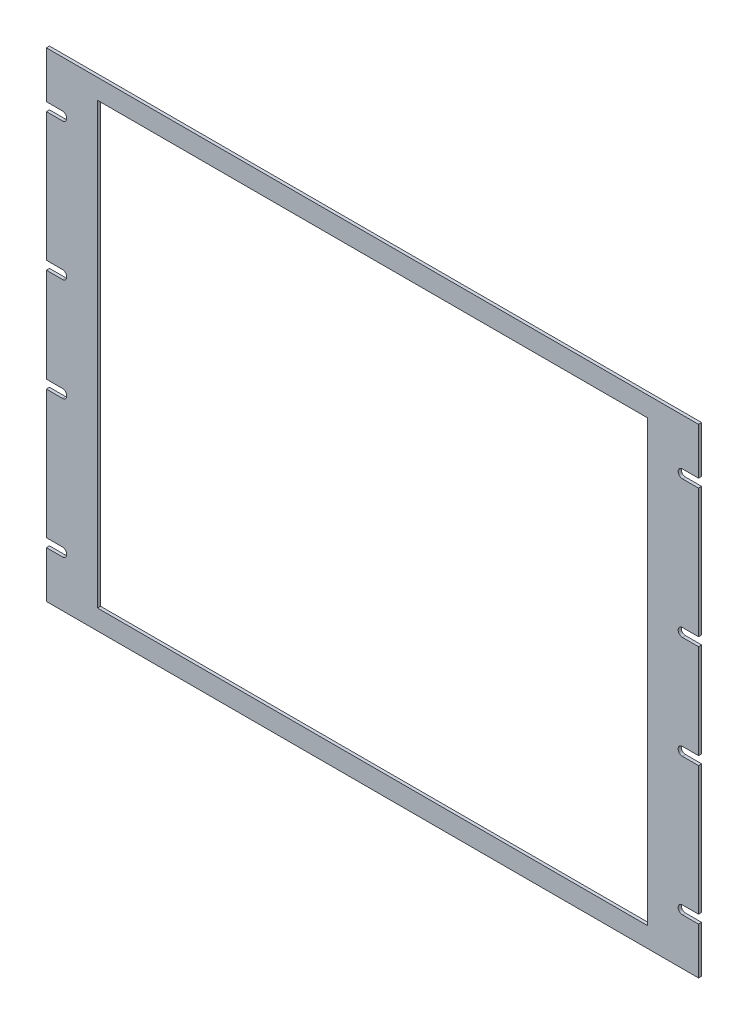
from build123d import *

# Parameters (mm, degrees)
MODEL_W             = 406.908
MODEL_H             = 325.374
BOSS_EXTRUDE1_DEPTH = 2.286


with BuildPart() as part:
    # Model → Boss-Extrude1 (new body)
    with BuildSketch(Plane.XY):
        with BuildLine():
            Line((241.3, -177.3936), (-241.3, -177.3936))
            Line((-241.3, -177.3936), (-241.3, -142.875))
            Line((-241.3, -142.875), (-229.3874, -142.875))
            ThreePointArc((-229.3874, -142.875), (-226.2124, -139.7), (-229.3874, -136.525))
            Line((-229.3874, -136.525), (-241.3, -136.525))
            Line((-241.3, -136.525), (-241.3, -41.275))
            Line((-241.3, -41.275), (-229.3874, -41.275))
            ThreePointArc((-229.3874, -41.275), (-226.2124, -38.1), (-229.3874, -34.925))
            Line((-229.3874, -34.925), (-241.3, -34.925))
            Line((-241.3, -34.925), (-241.3, 34.9249746))
            Line((-241.3, 34.9249746), (-229.3874, 34.9249746))
            ThreePointArc((-229.3874, 34.9249746), (-226.2124, 38.0999746), (-229.3874, 41.2749746))
            Line((-229.3874, 41.2749746), (-241.3, 41.2749746))
            Line((-241.3, 41.2749746), (-241.3, 136.525))
            Line((-241.3, 136.525), (-229.3874, 136.525))
            ThreePointArc((-229.3874, 136.525), (-226.2124, 139.7), (-229.3874, 142.875))
            Line((-229.3874, 142.875), (-241.3, 142.875))
            Line((-241.3, 142.875), (-241.3, 177.419))
            Line((-241.3, 177.419), (241.3, 177.419))
            Line((241.3, 177.419), (241.3, 142.875))
            Line((241.3, 142.875), (229.3874, 142.875))
            ThreePointArc((229.3874, 142.875), (226.2124, 139.7), (229.3874, 136.525))
            Line((229.3874, 136.525), (241.3, 136.525))
            Line((241.3, 136.525), (241.3, 41.2749746))
            Line((241.3, 41.2749746), (229.3874, 41.2749746))
            ThreePointArc((229.3874, 41.2749746), (226.2124, 38.0999746), (229.3874, 34.9249746))
            Line((229.3874, 34.9249746), (241.3, 34.9249746))
            Line((241.3, 34.9249746), (241.3, -34.925))
            Line((241.3, -34.925), (229.3874, -34.925))
            ThreePointArc((229.3874, -34.925), (226.2124, -38.1), (229.3874, -41.275))
            Line((229.3874, -41.275), (241.3, -41.275))
            Line((241.3, -41.275), (241.3, -136.525))
            Line((241.3, -136.525), (229.3874, -136.525))
            ThreePointArc((229.3874, -136.525), (226.2124, -139.7), (229.3874, -142.875))
            Line((229.3874, -142.875), (241.3, -142.875))
            Line((241.3, -142.875), (241.3, -177.3936))
        make_face()
        Rectangle(MODEL_W, MODEL_H, mode=Mode.SUBTRACT)
    extrude(amount=BOSS_EXTRUDE1_DEPTH)


solid = part.part
